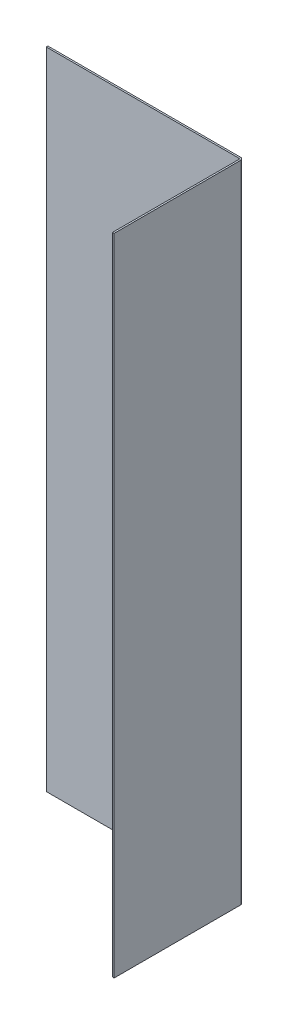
ISO-10303-21;
HEADER;
FILE_DESCRIPTION(('STEP AP214'),'2;1');
FILE_NAME('part.step','',(''),(''),'','','');
FILE_SCHEMA(('AUTOMOTIVE_DESIGN { 1 0 10303 214 1 1 1 1 }'));
ENDSEC;
DATA;
#1=APPLICATION_CONTEXT('core data for automotive mechanical design processes');
#2=APPLICATION_PROTOCOL_DEFINITION('international standard','automotive_design',2000,#1);
#3=PRODUCT_CONTEXT('',#1,'mechanical');
#4=PRODUCT('Part','Part','',(#3));
#5=PRODUCT_RELATED_PRODUCT_CATEGORY('part','',(#4));
#6=PRODUCT_DEFINITION_FORMATION('','',#4);
#7=PRODUCT_DEFINITION_CONTEXT('part definition',#1,'design');
#8=PRODUCT_DEFINITION('design','',#6,#7);
#9=PRODUCT_DEFINITION_SHAPE('','',#8);
#10=(LENGTH_UNIT() NAMED_UNIT(*) SI_UNIT(.MILLI.,.METRE.));
#11=(NAMED_UNIT(*) PLANE_ANGLE_UNIT() SI_UNIT($,.RADIAN.));
#12=(NAMED_UNIT(*) SI_UNIT($,.STERADIAN.) SOLID_ANGLE_UNIT());
#13=UNCERTAINTY_MEASURE_WITH_UNIT(LENGTH_MEASURE(1.E-05),#10,'distance_accuracy_value','');
#14=(GEOMETRIC_REPRESENTATION_CONTEXT(3) GLOBAL_UNCERTAINTY_ASSIGNED_CONTEXT((#13)) GLOBAL_UNIT_ASSIGNED_CONTEXT((#10,
#11,#12)) REPRESENTATION_CONTEXT('',''));
#15=CARTESIAN_POINT('',(0.,0.,0.));
#16=DIRECTION('',(0.,0.,1.));
#17=DIRECTION('',(1.,0.,0.));
#18=AXIS2_PLACEMENT_3D('',#15,#16,#17);
#19=CARTESIAN_POINT('',(194.5386,-0.7874,4.49579999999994));
#20=DIRECTION('',(0.,1.,0.));
#21=DIRECTION('',(0.,0.,1.));
#22=AXIS2_PLACEMENT_3D('',#19,#20,#21);
#23=PLANE('',#22);
#24=DIRECTION('',(-1.,0.,0.));
#25=VECTOR('',#24,1.);
#26=CARTESIAN_POINT('',(194.5386,-0.7874,4.49579999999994));
#27=LINE('',#26,#25);
#28=CARTESIAN_POINT('',(194.5386,-0.7874,4.49579999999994));
#29=VERTEX_POINT('',#28);
#30=CARTESIAN_POINT('',(191.2874,-0.7874,4.49579999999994));
#31=VERTEX_POINT('',#30);
#32=EDGE_CURVE('E11',#29,#31,#27,.T.);
#33=ORIENTED_EDGE('',*,*,#32,.F.);
#34=CARTESIAN_POINT('',(189.2554,-0.7874,4.49579999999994));
#35=DIRECTION('',(0.,1.,0.));
#36=DIRECTION('',(0.,0.,1.));
#37=AXIS2_PLACEMENT_3D('',#34,#35,#36);
#38=CIRCLE('',#37,5.2832);
#39=CARTESIAN_POINT('',(189.2554,-0.7874,-0.787400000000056));
#40=VERTEX_POINT('',#39);
#41=EDGE_CURVE('E172',#40,#29,#38,.F.);
#42=ORIENTED_EDGE('',*,*,#41,.F.);
#43=DIRECTION('',(0.,0.,-1.));
#44=VECTOR('',#43,1.);
#45=CARTESIAN_POINT('',(189.2554,-0.7874,2.46379999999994));
#46=LINE('',#45,#44);
#47=CARTESIAN_POINT('',(189.2554,-0.7874,2.46379999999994));
#48=VERTEX_POINT('',#47);
#49=EDGE_CURVE('E41',#48,#40,#46,.T.);
#50=ORIENTED_EDGE('',*,*,#49,.F.);
#51=CARTESIAN_POINT('',(189.2554,-0.7874,4.49579999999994));
#52=DIRECTION('',(0.,1.,0.));
#53=DIRECTION('',(-1.,0.,0.));
#54=AXIS2_PLACEMENT_3D('',#51,#52,#53);
#55=CIRCLE('',#54,2.032);
#56=EDGE_CURVE('E142',#48,#31,#55,.F.);
#57=ORIENTED_EDGE('',*,*,#56,.T.);
#58=EDGE_LOOP('',(#33,#42,#50,#57));
#59=FACE_BOUND('',#58,.T.);
#60=ADVANCED_FACE('F34',(#59),#23,.T.);
#61=CARTESIAN_POINT('',(189.2554,-0.7874,2.46379999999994));
#62=DIRECTION('',(0.,1.,0.));
#63=DIRECTION('',(0.,0.,1.));
#64=AXIS2_PLACEMENT_3D('',#61,#62,#63);
#65=PLANE('',#64);
#66=DIRECTION('',(0.,0.,1.));
#67=VECTOR('',#66,1.);
#68=CARTESIAN_POINT('',(194.5386,-0.7874,-0.787400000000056));
#69=LINE('',#68,#67);
#70=CARTESIAN_POINT('',(194.5386,-0.7874,253.2126));
#71=VERTEX_POINT('',#70);
#72=EDGE_CURVE('E174',#29,#71,#69,.T.);
#73=ORIENTED_EDGE('',*,*,#72,.F.);
#74=ORIENTED_EDGE('',*,*,#32,.T.);
#75=DIRECTION('',(0.,0.,1.));
#76=VECTOR('',#75,1.);
#77=CARTESIAN_POINT('',(191.2874,-0.7874,-0.787400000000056));
#78=LINE('',#77,#76);
#79=CARTESIAN_POINT('',(191.2874,-0.7874,253.2126));
#80=VERTEX_POINT('',#79);
#81=EDGE_CURVE('E180',#31,#80,#78,.T.);
#82=ORIENTED_EDGE('',*,*,#81,.T.);
#83=DIRECTION('',(-1.,0.,0.));
#84=VECTOR('',#83,1.);
#85=CARTESIAN_POINT('',(194.5386,-0.7874,253.2126));
#86=LINE('',#85,#84);
#87=EDGE_CURVE('E177',#71,#80,#86,.T.);
#88=ORIENTED_EDGE('',*,*,#87,.F.);
#89=EDGE_LOOP('',(#73,#74,#82,#88));
#90=FACE_BOUND('',#89,.T.);
#91=ADVANCED_FACE('F194',(#90),#65,.T.);
#92=CARTESIAN_POINT('',(191.2874,-1730.60734771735,-0.787400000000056));
#93=DIRECTION('',(-1.,0.,0.));
#94=DIRECTION('',(0.,0.,1.));
#95=AXIS2_PLACEMENT_3D('',#92,#93,#94);
#96=PLANE('',#95);
#97=DIRECTION('',(0.,1.,0.));
#98=VECTOR('',#97,1.);
#99=CARTESIAN_POINT('',(191.2874,-1730.60734771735,4.49579999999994));
#100=LINE('',#99,#98);
#101=CARTESIAN_POINT('',(191.2874,-1269.2126,4.49579999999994));
#102=VERTEX_POINT('',#101);
#103=EDGE_CURVE('E143',#102,#31,#100,.T.);
#104=ORIENTED_EDGE('',*,*,#103,.F.);
#105=DIRECTION('',(0.,0.,1.));
#106=VECTOR('',#105,1.);
#107=CARTESIAN_POINT('',(191.2874,-1269.2126,-0.787400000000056));
#108=LINE('',#107,#106);
#109=CARTESIAN_POINT('',(191.2874,-1269.2126,253.2126));
#110=VERTEX_POINT('',#109);
#111=EDGE_CURVE('E106',#102,#110,#108,.T.);
#112=ORIENTED_EDGE('',*,*,#111,.T.);
#113=DIRECTION('',(0.,1.,0.));
#114=VECTOR('',#113,1.);
#115=CARTESIAN_POINT('',(191.2874,-1730.60734771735,253.2126));
#116=LINE('',#115,#114);
#117=EDGE_CURVE('E141',#110,#80,#116,.T.);
#118=ORIENTED_EDGE('',*,*,#117,.T.);
#119=ORIENTED_EDGE('',*,*,#81,.F.);
#120=EDGE_LOOP('',(#104,#112,#118,#119));
#121=FACE_BOUND('',#120,.T.);
#122=ADVANCED_FACE('F204',(#121),#96,.T.);
#123=CARTESIAN_POINT('',(189.2554,-1730.60734771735,4.49579999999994));
#124=DIRECTION('',(0.,1.,0.));
#125=DIRECTION('',(0.,0.,1.));
#126=AXIS2_PLACEMENT_3D('',#123,#124,#125);
#127=CYLINDRICAL_SURFACE('',#126,2.032);
#128=DIRECTION('',(0.,1.,0.));
#129=VECTOR('',#128,1.);
#130=CARTESIAN_POINT('',(189.2554,-1730.60734771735,2.46379999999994));
#131=LINE('',#130,#129);
#132=CARTESIAN_POINT('',(189.2554,-1269.2126,2.46379999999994));
#133=VERTEX_POINT('',#132);
#134=EDGE_CURVE('E146',#133,#48,#131,.T.);
#135=ORIENTED_EDGE('',*,*,#134,.F.);
#136=CARTESIAN_POINT('',(189.2554,-1269.2126,4.49579999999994));
#137=DIRECTION('',(0.,1.,0.));
#138=DIRECTION('',(0.,0.,1.));
#139=AXIS2_PLACEMENT_3D('',#136,#137,#138);
#140=CIRCLE('',#139,2.032);
#141=EDGE_CURVE('E103',#102,#133,#140,.T.);
#142=ORIENTED_EDGE('',*,*,#141,.F.);
#143=ORIENTED_EDGE('',*,*,#103,.T.);
#144=ORIENTED_EDGE('',*,*,#56,.F.);
#145=EDGE_LOOP('',(#135,#142,#143,#144));
#146=FACE_BOUND('',#145,.T.);
#147=ADVANCED_FACE('F191',(#146),#127,.F.);
#148=CARTESIAN_POINT('',(-189.70498,-1730.60734771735,2.46379999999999));
#149=DIRECTION('',(0.,0.,1.));
#150=DIRECTION('',(1.,0.,0.));
#151=AXIS2_PLACEMENT_3D('',#148,#149,#150);
#152=PLANE('',#151);
#153=DIRECTION('',(0.,1.,0.));
#154=VECTOR('',#153,1.);
#155=CARTESIAN_POINT('',(-189.70498,-1730.60734771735,2.46379999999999));
#156=LINE('',#155,#154);
#157=CARTESIAN_POINT('',(-189.70498,-1269.2126,2.46379999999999));
#158=VERTEX_POINT('',#157);
#159=CARTESIAN_POINT('',(-189.70498,-0.7874,2.46379999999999));
#160=VERTEX_POINT('',#159);
#161=EDGE_CURVE('E134',#158,#160,#156,.T.);
#162=ORIENTED_EDGE('',*,*,#161,.F.);
#163=DIRECTION('',(1.,0.,0.));
#164=VECTOR('',#163,1.);
#165=CARTESIAN_POINT('',(-189.70498,-1269.2126,2.46379999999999));
#166=LINE('',#165,#164);
#167=EDGE_CURVE('E116',#158,#133,#166,.T.);
#168=ORIENTED_EDGE('',*,*,#167,.T.);
#169=ORIENTED_EDGE('',*,*,#134,.T.);
#170=DIRECTION('',(1.,0.,0.));
#171=VECTOR('',#170,1.);
#172=CARTESIAN_POINT('',(-189.70498,-0.7874,2.46379999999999));
#173=LINE('',#172,#171);
#174=EDGE_CURVE('E165',#160,#48,#173,.T.);
#175=ORIENTED_EDGE('',*,*,#174,.F.);
#176=EDGE_LOOP('',(#162,#168,#169,#175));
#177=FACE_BOUND('',#176,.T.);
#178=ADVANCED_FACE('F167',(#177),#152,.T.);
#179=CARTESIAN_POINT('',(-189.70498,-1730.60734771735,2.46379999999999));
#180=DIRECTION('',(1.,0.,0.));
#181=DIRECTION('',(0.,0.,-1.));
#182=AXIS2_PLACEMENT_3D('',#179,#180,#181);
#183=PLANE('',#182);
#184=DIRECTION('',(0.,0.,-1.));
#185=VECTOR('',#184,1.);
#186=CARTESIAN_POINT('',(-189.70498,-1269.2126,-0.787400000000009));
#187=LINE('',#186,#185);
#188=CARTESIAN_POINT('',(-189.70498,-1269.2126,-0.787400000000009));
#189=VERTEX_POINT('',#188);
#190=EDGE_CURVE('E107',#189,#158,#187,.F.);
#191=ORIENTED_EDGE('',*,*,#190,.T.);
#192=ORIENTED_EDGE('',*,*,#161,.T.);
#193=DIRECTION('',(0.,0.,-1.));
#194=VECTOR('',#193,1.);
#195=CARTESIAN_POINT('',(-189.70498,-0.7874,2.46379999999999));
#196=LINE('',#195,#194);
#197=CARTESIAN_POINT('',(-189.70498,-0.7874,-0.787400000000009));
#198=VERTEX_POINT('',#197);
#199=EDGE_CURVE('E161',#160,#198,#196,.T.);
#200=ORIENTED_EDGE('',*,*,#199,.T.);
#201=DIRECTION('',(0.,1.,0.));
#202=VECTOR('',#201,1.);
#203=CARTESIAN_POINT('',(-189.70498,-1730.60734771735,-0.787400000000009));
#204=LINE('',#203,#202);
#205=EDGE_CURVE('E132',#189,#198,#204,.T.);
#206=ORIENTED_EDGE('',*,*,#205,.F.);
#207=EDGE_LOOP('',(#191,#192,#200,#206));
#208=FACE_BOUND('',#207,.T.);
#209=ADVANCED_FACE('F160',(#208),#183,.F.);
#210=CARTESIAN_POINT('',(-189.70498,-1730.60734771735,-0.787400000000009));
#211=DIRECTION('',(0.,0.,1.));
#212=DIRECTION('',(1.,0.,0.));
#213=AXIS2_PLACEMENT_3D('',#210,#211,#212);
#214=PLANE('',#213);
#215=DIRECTION('',(1.,0.,0.));
#216=VECTOR('',#215,1.);
#217=CARTESIAN_POINT('',(-189.70498,-1269.2126,-0.787400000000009));
#218=LINE('',#217,#216);
#219=CARTESIAN_POINT('',(189.2554,-1269.2126,-0.787400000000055));
#220=VERTEX_POINT('',#219);
#221=EDGE_CURVE('E110',#189,#220,#218,.T.);
#222=ORIENTED_EDGE('',*,*,#221,.F.);
#223=ORIENTED_EDGE('',*,*,#205,.T.);
#224=DIRECTION('',(1.,0.,0.));
#225=VECTOR('',#224,1.);
#226=CARTESIAN_POINT('',(-189.70498,-0.7874,-0.787400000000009));
#227=LINE('',#226,#225);
#228=EDGE_CURVE('E130',#198,#40,#227,.T.);
#229=ORIENTED_EDGE('',*,*,#228,.T.);
#230=DIRECTION('',(0.,1.,0.));
#231=VECTOR('',#230,1.);
#232=CARTESIAN_POINT('',(189.2554,-1730.60734771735,-0.787400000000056));
#233=LINE('',#232,#231);
#234=EDGE_CURVE('E123',#220,#40,#233,.T.);
#235=ORIENTED_EDGE('',*,*,#234,.F.);
#236=EDGE_LOOP('',(#222,#223,#229,#235));
#237=FACE_BOUND('',#236,.T.);
#238=ADVANCED_FACE('F128',(#237),#214,.F.);
#239=CARTESIAN_POINT('',(189.2554,-1730.60734771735,4.49579999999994));
#240=DIRECTION('',(0.,1.,0.));
#241=DIRECTION('',(0.,0.,1.));
#242=AXIS2_PLACEMENT_3D('',#239,#240,#241);
#243=CYLINDRICAL_SURFACE('',#242,5.2832);
#244=CARTESIAN_POINT('',(189.2554,-1269.2126,4.49579999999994));
#245=DIRECTION('',(0.,-1.,0.));
#246=DIRECTION('',(0.,0.,-1.));
#247=AXIS2_PLACEMENT_3D('',#244,#245,#246);
#248=CIRCLE('',#247,5.2832);
#249=CARTESIAN_POINT('',(194.5386,-1269.2126,4.49579999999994));
#250=VERTEX_POINT('',#249);
#251=EDGE_CURVE('E101',#220,#250,#248,.T.);
#252=ORIENTED_EDGE('',*,*,#251,.F.);
#253=ORIENTED_EDGE('',*,*,#234,.T.);
#254=ORIENTED_EDGE('',*,*,#41,.T.);
#255=DIRECTION('',(0.,1.,0.));
#256=VECTOR('',#255,1.);
#257=CARTESIAN_POINT('',(194.5386,-1730.60734771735,4.49579999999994));
#258=LINE('',#257,#256);
#259=EDGE_CURVE('E126',#250,#29,#258,.T.);
#260=ORIENTED_EDGE('',*,*,#259,.F.);
#261=EDGE_LOOP('',(#252,#253,#254,#260));
#262=FACE_BOUND('',#261,.T.);
#263=ADVANCED_FACE('F121',(#262),#243,.T.);
#264=CARTESIAN_POINT('',(194.5386,-1730.60734771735,-0.787400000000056));
#265=DIRECTION('',(-1.,0.,0.));
#266=DIRECTION('',(0.,0.,1.));
#267=AXIS2_PLACEMENT_3D('',#264,#265,#266);
#268=PLANE('',#267);
#269=DIRECTION('',(0.,0.,1.));
#270=VECTOR('',#269,1.);
#271=CARTESIAN_POINT('',(194.5386,-1269.2126,-0.787400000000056));
#272=LINE('',#271,#270);
#273=CARTESIAN_POINT('',(194.5386,-1269.2126,253.2126));
#274=VERTEX_POINT('',#273);
#275=EDGE_CURVE('E48',#250,#274,#272,.T.);
#276=ORIENTED_EDGE('',*,*,#275,.F.);
#277=ORIENTED_EDGE('',*,*,#259,.T.);
#278=ORIENTED_EDGE('',*,*,#72,.T.);
#279=DIRECTION('',(0.,1.,0.));
#280=VECTOR('',#279,1.);
#281=CARTESIAN_POINT('',(194.5386,-1730.60734771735,253.2126));
#282=LINE('',#281,#280);
#283=EDGE_CURVE('E136',#274,#71,#282,.T.);
#284=ORIENTED_EDGE('',*,*,#283,.F.);
#285=EDGE_LOOP('',(#276,#277,#278,#284));
#286=FACE_BOUND('',#285,.T.);
#287=ADVANCED_FACE('F197',(#286),#268,.F.);
#288=CARTESIAN_POINT('',(194.5386,-1730.60734771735,253.2126));
#289=DIRECTION('',(0.,0.,-1.));
#290=DIRECTION('',(-1.,0.,0.));
#291=AXIS2_PLACEMENT_3D('',#288,#289,#290);
#292=PLANE('',#291);
#293=DIRECTION('',(-1.,0.,0.));
#294=VECTOR('',#293,1.);
#295=CARTESIAN_POINT('',(191.2874,-1269.2126,253.2126));
#296=LINE('',#295,#294);
#297=EDGE_CURVE('E182',#110,#274,#296,.F.);
#298=ORIENTED_EDGE('',*,*,#297,.T.);
#299=ORIENTED_EDGE('',*,*,#283,.T.);
#300=ORIENTED_EDGE('',*,*,#87,.T.);
#301=ORIENTED_EDGE('',*,*,#117,.F.);
#302=EDGE_LOOP('',(#298,#299,#300,#301));
#303=FACE_BOUND('',#302,.T.);
#304=ADVANCED_FACE('F199',(#303),#292,.F.);
#305=CARTESIAN_POINT('',(189.2554,-0.7874,4.49579999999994));
#306=DIRECTION('',(0.,1.,0.));
#307=DIRECTION('',(-1.,0.,0.));
#308=AXIS2_PLACEMENT_3D('',#305,#306,#307);
#309=PLANE('',#308);
#310=ORIENTED_EDGE('',*,*,#174,.T.);
#311=ORIENTED_EDGE('',*,*,#49,.T.);
#312=ORIENTED_EDGE('',*,*,#228,.F.);
#313=ORIENTED_EDGE('',*,*,#199,.F.);
#314=EDGE_LOOP('',(#310,#311,#312,#313));
#315=FACE_BOUND('',#314,.T.);
#316=ADVANCED_FACE('F164',(#315),#309,.T.);
#317=CARTESIAN_POINT('',(191.2874,-1269.2126,-0.787400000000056));
#318=DIRECTION('',(0.,-1.,0.));
#319=DIRECTION('',(0.,0.,1.));
#320=AXIS2_PLACEMENT_3D('',#317,#318,#319);
#321=PLANE('',#320);
#322=ORIENTED_EDGE('',*,*,#297,.F.);
#323=ORIENTED_EDGE('',*,*,#111,.F.);
#324=DIRECTION('',(-1.,0.,0.));
#325=VECTOR('',#324,1.);
#326=CARTESIAN_POINT('',(191.2874,-1269.2126,4.49579999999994));
#327=LINE('',#326,#325);
#328=EDGE_CURVE('E183',#102,#250,#327,.F.);
#329=ORIENTED_EDGE('',*,*,#328,.T.);
#330=ORIENTED_EDGE('',*,*,#275,.T.);
#331=EDGE_LOOP('',(#322,#323,#329,#330));
#332=FACE_BOUND('',#331,.T.);
#333=ADVANCED_FACE('F202',(#332),#321,.T.);
#334=CARTESIAN_POINT('',(-189.70498,-1269.2126,-0.787400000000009));
#335=DIRECTION('',(0.,-1.,0.));
#336=DIRECTION('',(1.,0.,0.));
#337=AXIS2_PLACEMENT_3D('',#334,#335,#336);
#338=PLANE('',#337);
#339=ORIENTED_EDGE('',*,*,#221,.T.);
#340=DIRECTION('',(0.,0.,-1.));
#341=VECTOR('',#340,1.);
#342=CARTESIAN_POINT('',(189.2554,-1269.2126,-0.787400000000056));
#343=LINE('',#342,#341);
#344=EDGE_CURVE('E97',#220,#133,#343,.F.);
#345=ORIENTED_EDGE('',*,*,#344,.T.);
#346=ORIENTED_EDGE('',*,*,#167,.F.);
#347=ORIENTED_EDGE('',*,*,#190,.F.);
#348=EDGE_LOOP('',(#339,#345,#346,#347));
#349=FACE_BOUND('',#348,.T.);
#350=ADVANCED_FACE('F111',(#349),#338,.T.);
#351=CARTESIAN_POINT('',(189.2554,-1269.2126,4.49579999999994));
#352=DIRECTION('',(0.,1.,0.));
#353=DIRECTION('',(0.,0.,1.));
#354=AXIS2_PLACEMENT_3D('',#351,#352,#353);
#355=PLANE('',#354);
#356=ORIENTED_EDGE('',*,*,#141,.T.);
#357=ORIENTED_EDGE('',*,*,#344,.F.);
#358=ORIENTED_EDGE('',*,*,#251,.T.);
#359=ORIENTED_EDGE('',*,*,#328,.F.);
#360=EDGE_LOOP('',(#356,#357,#358,#359));
#361=FACE_BOUND('',#360,.T.);
#362=ADVANCED_FACE('F99',(#361),#355,.F.);
#363=CLOSED_SHELL('',(#60,#91,#122,#147,#178,#209,#238,#263,#287,#304,#316,#333,#350,#362));
#364=MANIFOLD_SOLID_BREP('B2',#363);
#365=ADVANCED_BREP_SHAPE_REPRESENTATION('',(#18,#364),#14);
#366=SHAPE_DEFINITION_REPRESENTATION(#9,#365);
ENDSEC;
END-ISO-10303-21;
